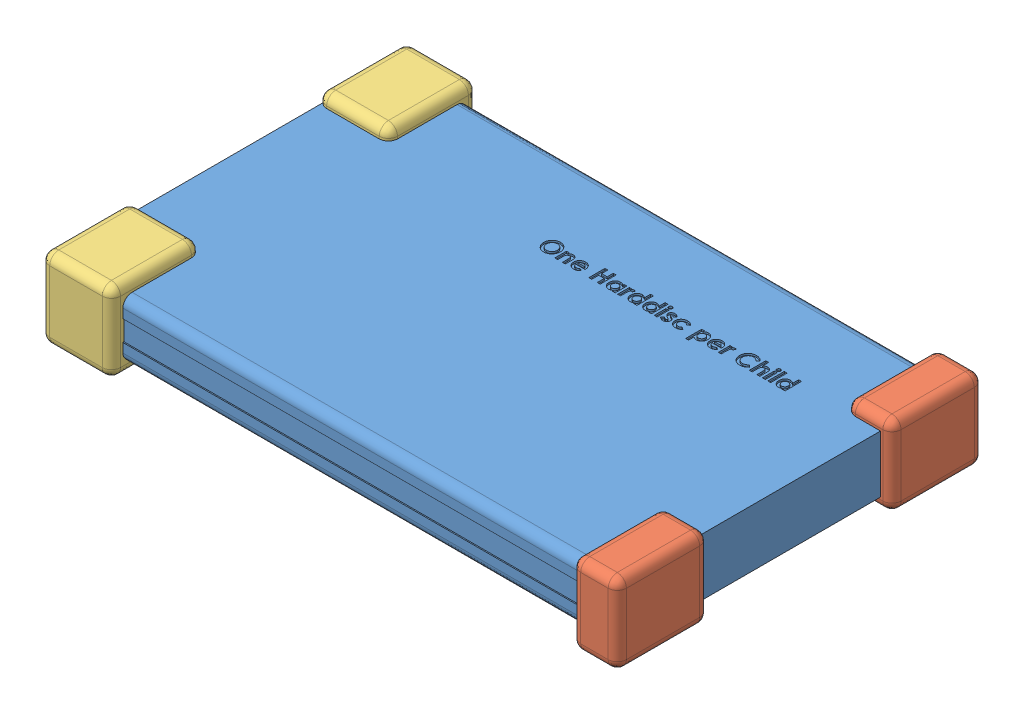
SolidWorks assembly Hard Drive Housing With Rubber Corners.SLDASM, configuration Default (file format 3800). Lengths in mm.
Overall size (126 17.5 80).
3 component instances, 3 part files, 8 mates.
Components (placement in the parent):
- 3DSolidWorks-Hard Drive Housing-1: 3DSolidWorks-Hard Drive Housing.SLDPRT [Default] at (-95.613 24.3398 -1.0828) size (123 12.5 75)
- 3DSolidWorks-Hard Drive Rubber Corners-1: 3DSolidWorks-Hard Drive Rubber Corners.SLDPRT [Default] at (27.387 24.3398 -1.0828) x (0 0 -1) z (1 0 0) size (80 17.5 10)
- 3DSolidWorks-Hard Drive Rubber Corners - front-1: 3DSolidWorks-Hard Drive Rubber Corners - front.SLDPRT [Default] at (-95.613 24.3398 -1.0828) x (0 0 1) z (-1 0 0) size (80 17.5 15.5)
Mates (geometry in assembly coordinates):
- Platziert1: in place: plane of 3DSolidWorks-Hard Drive Housing-1 through (27.387 32.3398 34.4172) normal (1 0 0); unknown of 3DSolidWorks-Hard Drive Rubber Corners-1
- Deckungsgleich1: coincident aligned: plane of ?; plane of ?
- Deckungsgleich2: coincident aligned: moOrthogonalPlaneRef_w of ?; plane of ?
- Deckungsgleich3: coincident anti-aligned: moOrthogonalPlaneRef_w of ?; plane of ?
- Platziert2: in place: unknown of 3DSolidWorks-Hard Drive Housing-1; unknown of 3DSolidWorks-Hard Drive Rubber Corners - front-1
- Deckungsgleich1: coincident aligned: plane of ?; plane of ?
- Deckungsgleich2: coincident aligned: moOrthogonalPlaneRef_w of ?; plane of ?
- Deckungsgleich3: coincident anti-aligned: moOrthogonalPlaneRef_w of ?; plane of ?
